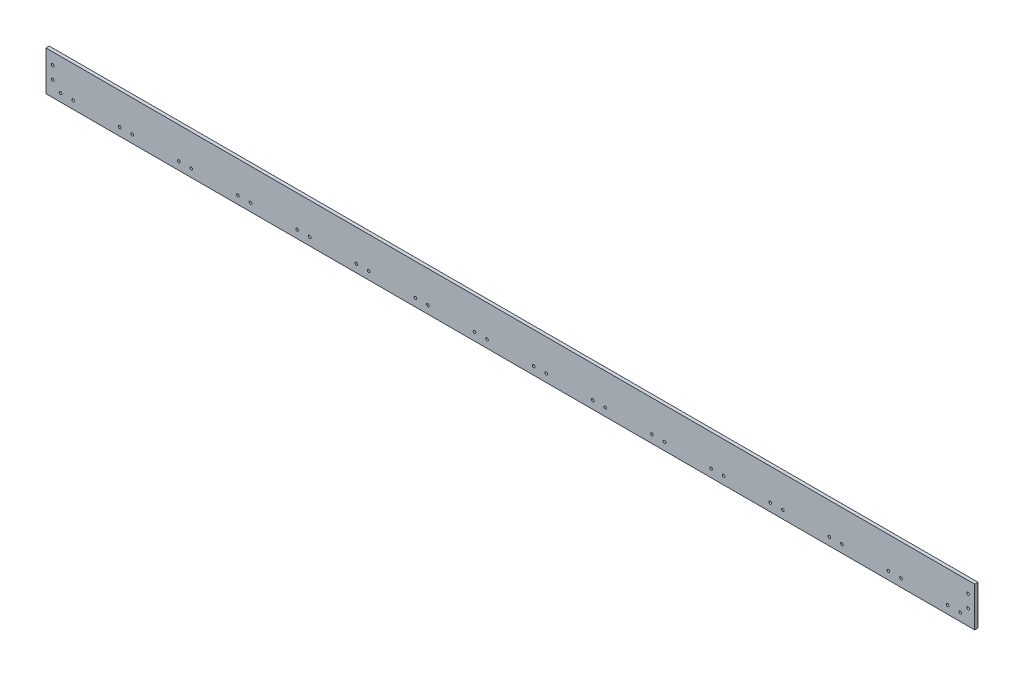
from build123d import *

# Parameters (mm, degrees)
SKETCH1_W           = 1784.35
SKETCH1_H           = 76.2
BOSS_EXTRUDE1_DEPTH = 6.35
SKETCH2_R           = 2.54
CUT_EXTRUDE1_DEPTH  = 6.35
SKETCH3_R           = 2.54
CUT_EXTRUDE2_DEPTH  = 6.35
LPATTERN2_COUNT     = 16
LPATTERN2_PITCH     = 113.622666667


with BuildPart() as part:
    # Sketch1 → Boss-Extrude1 (new body)
    with BuildSketch(Plane.XY):
        with Locations((892.175, 38.1)):
            Rectangle(SKETCH1_W, SKETCH1_H)
    extrude(amount=BOSS_EXTRUDE1_DEPTH)

    # Sketch2 → Cut-Extrude1 (cut)
    with BuildSketch(Plane.XY.offset(6.35)):
        with Locations((27.94, 15.24)):
            Circle(SKETCH2_R)
        with Locations((52.07, 15.24)):
            Circle(SKETCH2_R)
    cut_extrude1 = extrude(amount=-CUT_EXTRUDE1_DEPTH, mode=Mode.SUBTRACT)

    # Sketch3 → Cut-Extrude2 (cut)
    with BuildSketch(Plane.XY.offset(6.35)):
        with Locations((12.7, 29.845)):
            Circle(SKETCH3_R)
        with Locations((12.7, 53.975)):
            Circle(SKETCH3_R)
        with Locations(Location((1771.65, 29.845, 0), (0, 0, 180))):
            Circle(SKETCH3_R)
        with Locations(Location((1771.65, 53.975, 0), (0, 0, 180))):
            Circle(SKETCH3_R)
    extrude(amount=-CUT_EXTRUDE2_DEPTH, mode=Mode.SUBTRACT)

    # LPattern2: Cut-Extrude1 ×16
    with Locations(*[(i * LPATTERN2_PITCH, 0, 0) for i in range(1, LPATTERN2_COUNT)]):
        add(cut_extrude1, mode=Mode.SUBTRACT)


solid = part.part
